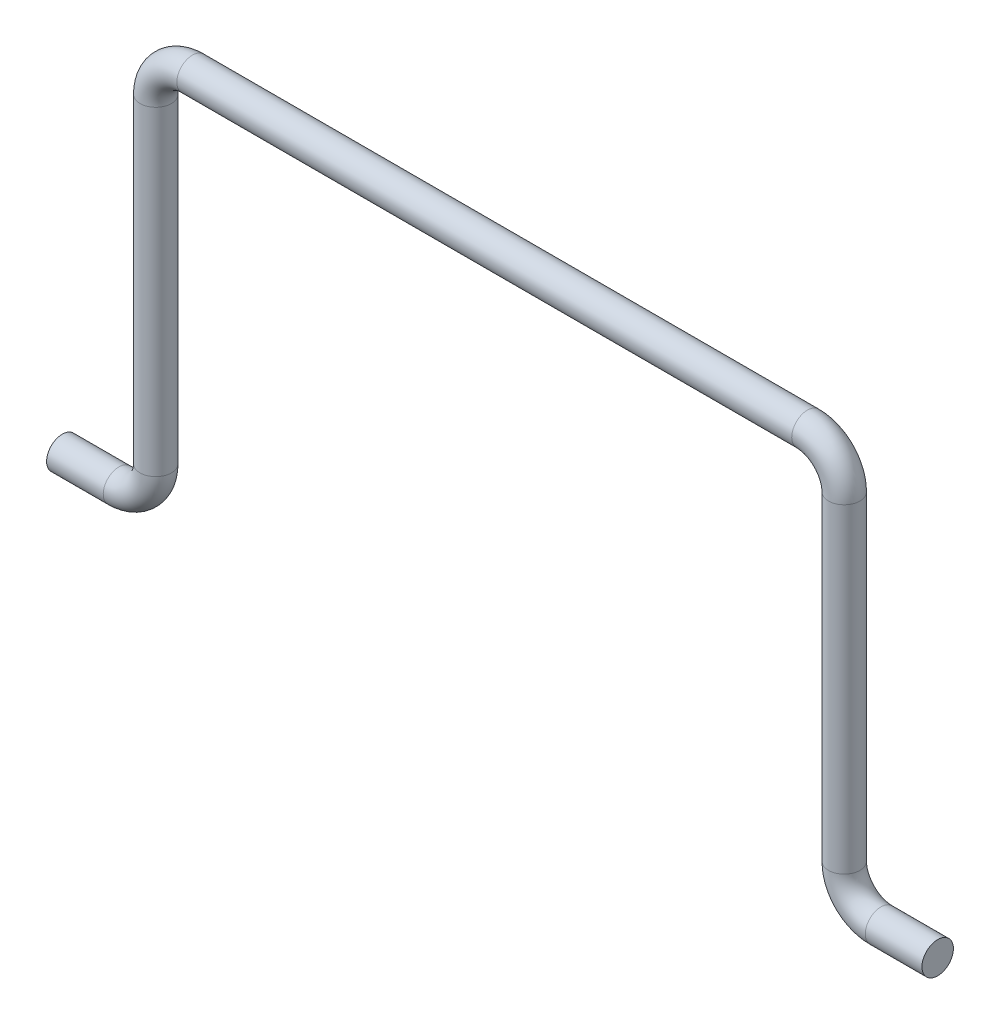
from build123d import *

# Parameters (mm, degrees)
SKETCH2_R = 2.032


with BuildPart() as part:
    # Base-Sweep: sweep along a path in Sketch1
    with BuildLine(Plane.XY) as base_sweep_path:
        Line((-56.515, 0), (-49.1998, 0))
        ThreePointArc((-49.1998, 0), (-45.841184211, 1.391184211), (-44.45, 4.7498))
        Line((-44.45, 4.7498), (-44.45, 46.0502))
        ThreePointArc((-44.45, 46.0502), (-43.058815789, 49.408815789), (-39.7002, 50.8))
        Line((-39.7002, 50.8), (39.7002, 50.8))
        ThreePointArc((39.7002, 50.8), (43.058815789, 49.408815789), (44.45, 46.0502))
        Line((44.45, 46.0502), (44.45, 4.7498))
        ThreePointArc((44.45, 4.7498), (45.841184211, 1.391184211), (49.1998, 0))
        Line((49.1998, 0), (56.515, 0))
    # Sketch2 → Base-Sweep (sweep)
    with BuildSketch(Plane(origin=(56.515, 0, 0), x_dir=(0, 0, -1), z_dir=(1, 0, 0))):
        Circle(SKETCH2_R)
    sweep(path=base_sweep_path.line)


solid = part.part
